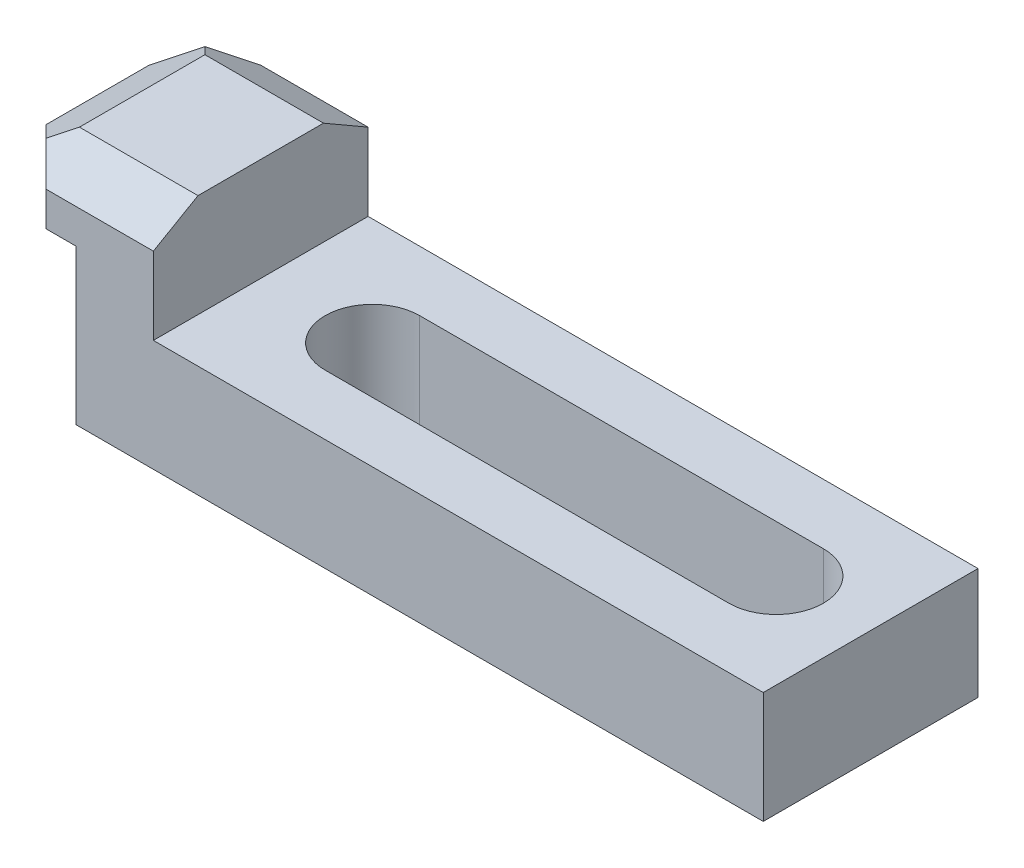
from build123d import *
from OCP.BRepFilletAPI import BRepFilletAPI_MakeChamfer

# Parameters (mm, degrees)
EXTRUDE1_DEPTH = 12.5
CHAMFER1_SIZE  = 3
CHAMFER1_SIZE2 = 5.196152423
EXTRUDE2_DEPTH = 95.240384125


with BuildPart() as part:
    # Sketch1 → Extrude1 (new, symmetric)
    with BuildSketch(Plane.XY):
        Polygon((0, 0), (10, 0), (10, -18), (90, -18), (90, -5), (19, -5), (19, 7), (0, 7), align=None)
    extrude(amount=EXTRUDE1_DEPTH, both=True)

    # Chamfer1: one chamfer whose edges measure the first distance from different faces: ONE call of the kernel's chamfer builder (chamfer() names one face for all edges)
    chamfer1_edges_1 = [part.edges().sort_by_distance(p)[0] for p in [
        (0, 7, 0),
    ]]
    chamfer1_side_1 = [part.faces().sort_by_distance(p)[0] for p in [
        (0, 3.5, 0),
    ]]
    chamfer1_edges_2 = [part.edges().sort_by_distance(p)[0] for p in [
        (9.5, 7, 12.5),
    ]]
    chamfer1_side_2 = [part.faces().sort_by_distance(p)[0] for p in [
        (44.266009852, -9.52955665, 12.5),
    ]]
    chamfer1_edges_3 = [part.edges().sort_by_distance(p)[0] for p in [
        (9.5, 7, -12.5),
    ]]
    chamfer1_side_3 = [part.faces().sort_by_distance(p)[0] for p in [
        (44.266009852, -9.52955665, -12.5),
    ]]
    chamfer1 = BRepFilletAPI_MakeChamfer(part.part.solid().wrapped)
    for e in chamfer1_edges_1:
        chamfer1.Add(CHAMFER1_SIZE, CHAMFER1_SIZE2, e.wrapped, chamfer1_side_1[0].wrapped)  # the first distance lies on this face
    for e in chamfer1_edges_2:
        chamfer1.Add(CHAMFER1_SIZE, CHAMFER1_SIZE2, e.wrapped, chamfer1_side_2[0].wrapped)  # the first distance lies on this face
    for e in chamfer1_edges_3:
        chamfer1.Add(CHAMFER1_SIZE, CHAMFER1_SIZE2, e.wrapped, chamfer1_side_3[0].wrapped)  # the first distance lies on this face
    add(Compound.cast(chamfer1.Shape()), mode=Mode.REPLACE)

    # Sketch2 → Extrude2 (cut, through all)
    with BuildSketch(Plane.XZ.offset(18)):
        with BuildLine():
            Line((32, 5.5), (79, 5.5))
            ThreePointArc((79, 5.5), (84.5, 0), (79, -5.5))
            Line((79, -5.5), (32, -5.5))
            ThreePointArc((32, -5.5), (26.5, 0), (32, 5.5))
        make_face()
        Polygon((0, 12.5), (6.5, 12.5), (0, 6), align=None)
        Polygon((0, -6), (0, -12.5), (6.5, -12.5), align=None)
    extrude(amount=-EXTRUDE2_DEPTH, mode=Mode.SUBTRACT)


solid = part.part
